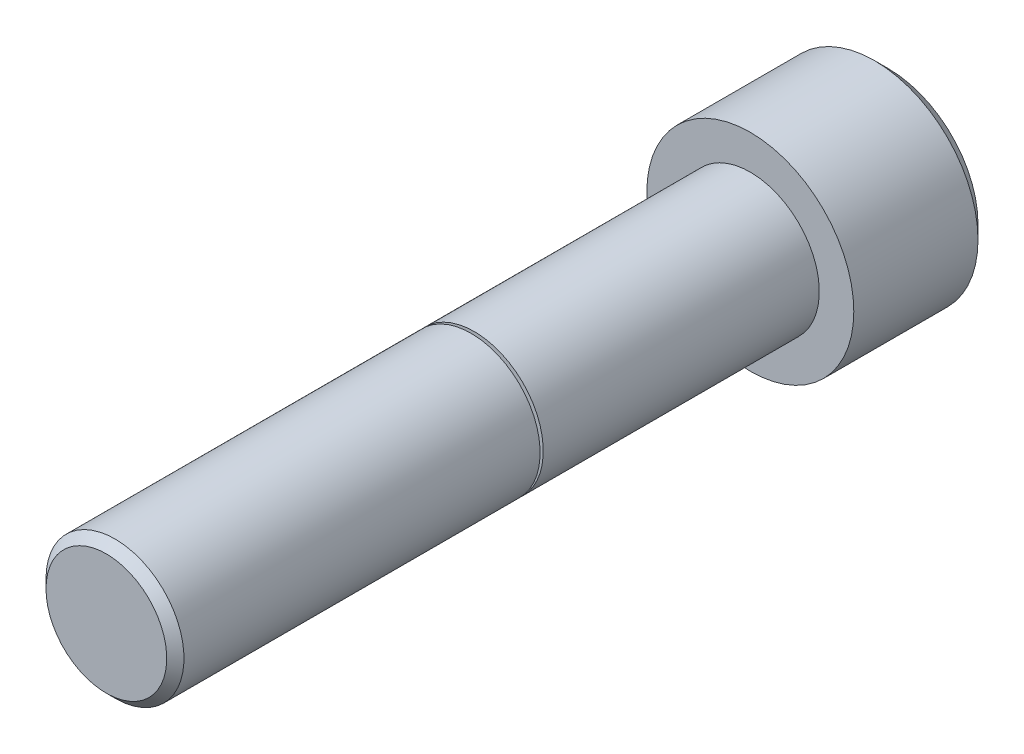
from build123d import *

# Parameters (mm, degrees)
CUT_EXTRUDE1_DEPTH = 9.525


with BuildPart() as part:
    # Logo3_bib1 → Revolve1 (revolve)
    with BuildSketch(Plane(origin=(0, 0, 0), x_dir=(-1, 0, 0), z_dir=(0, -1, 0))):
        with BuildLine():
            Line((0, -88.9), (0, 19.05))
            Line((0, 19.05), (12.3825, 19.05))
            Line((12.3825, 19.05), (14.2875, 17.145))
            Line((14.2875, 17.145), (14.2875, 0))
            Line((14.2875, 0), (9.525, 0))
            Line((9.525, 0), (9.525, -38.11))
            Line((9.525, -38.11), (8.447165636, -38.11))
            ThreePointArc((8.447165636, -38.11), (8.427469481, -38.126527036), (8.440325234, -38.148793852))
            Line((8.440325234, -38.148793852), (9.525, -38.543583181))
            Line((9.525, -38.543583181), (9.525, -87.70874))
            Line((9.525, -87.70874), (8.33374, -88.9))
            Line((8.33374, -88.9), (0, -88.9))
        make_face()
    revolve(axis=Axis((0, 0, -10.585154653), (0, 0, 1)))

    # Logo3_bib2 → Cut-Extrude1 (cut)
    with BuildSketch(Plane(origin=(0, 0, -19.05), x_dir=(1, 0, 0), z_dir=(0, 0, -1))):
        Polygon((9.165435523, 0), (4.582717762, 7.9375), (-4.582717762, 7.9375), (-9.165435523, 0), (-4.582717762, -7.9375), (4.582717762, -7.9375), align=None)
    extrude(amount=-CUT_EXTRUDE1_DEPTH, mode=Mode.SUBTRACT)


solid = part.part
